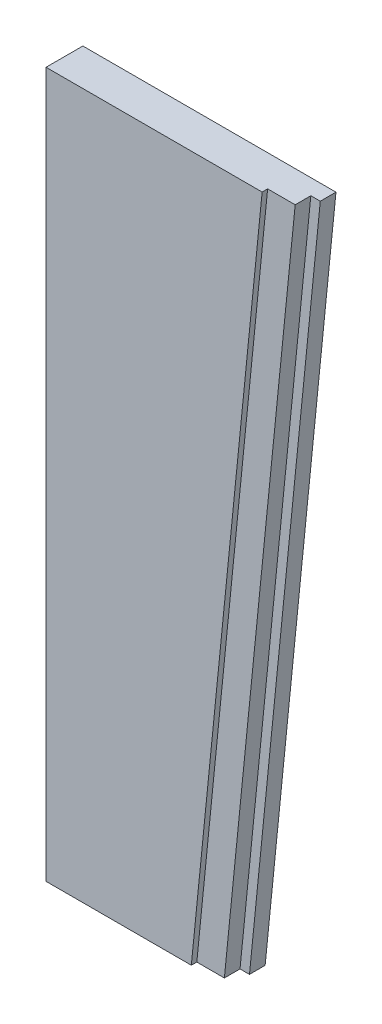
ISO-10303-21;
HEADER;
FILE_DESCRIPTION(('STEP AP214'),'2;1');
FILE_NAME('part.step','',(''),(''),'','','');
FILE_SCHEMA(('AUTOMOTIVE_DESIGN { 1 0 10303 214 1 1 1 1 }'));
ENDSEC;
DATA;
#1=APPLICATION_CONTEXT('core data for automotive mechanical design processes');
#2=APPLICATION_PROTOCOL_DEFINITION('international standard','automotive_design',2000,#1);
#3=PRODUCT_CONTEXT('',#1,'mechanical');
#4=PRODUCT('Part','Part','',(#3));
#5=PRODUCT_RELATED_PRODUCT_CATEGORY('part','',(#4));
#6=PRODUCT_DEFINITION_FORMATION('','',#4);
#7=PRODUCT_DEFINITION_CONTEXT('part definition',#1,'design');
#8=PRODUCT_DEFINITION('design','',#6,#7);
#9=PRODUCT_DEFINITION_SHAPE('','',#8);
#10=(LENGTH_UNIT() NAMED_UNIT(*) SI_UNIT(.MILLI.,.METRE.));
#11=(NAMED_UNIT(*) PLANE_ANGLE_UNIT() SI_UNIT($,.RADIAN.));
#12=(NAMED_UNIT(*) SI_UNIT($,.STERADIAN.) SOLID_ANGLE_UNIT());
#13=UNCERTAINTY_MEASURE_WITH_UNIT(LENGTH_MEASURE(1.E-05),#10,'distance_accuracy_value','');
#14=(GEOMETRIC_REPRESENTATION_CONTEXT(3) GLOBAL_UNCERTAINTY_ASSIGNED_CONTEXT((#13)) GLOBAL_UNIT_ASSIGNED_CONTEXT((#10,
#11,#12)) REPRESENTATION_CONTEXT('',''));
#15=CARTESIAN_POINT('',(0.,0.,0.));
#16=DIRECTION('',(0.,0.,1.));
#17=DIRECTION('',(1.,0.,0.));
#18=AXIS2_PLACEMENT_3D('',#15,#16,#17);
#19=CARTESIAN_POINT('',(-1786.46075731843,-2.18771119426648E-13,47.));
#20=DIRECTION('',(1.,0.,0.));
#21=DIRECTION('',(0.,0.,-1.));
#22=AXIS2_PLACEMENT_3D('',#19,#20,#21);
#23=PLANE('',#22);
#24=DIRECTION('',(0.,-1.,0.));
#25=VECTOR('',#24,1.);
#26=CARTESIAN_POINT('',(-1786.46075731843,-2.18771119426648E-13,0.));
#27=LINE('',#26,#25);
#28=CARTESIAN_POINT('',(-1786.46075731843,-2.18771119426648E-13,0.));
#29=VERTEX_POINT('',#28);
#30=CARTESIAN_POINT('',(-1786.46075731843,-900.,0.));
#31=VERTEX_POINT('',#30);
#32=EDGE_CURVE('E100',#29,#31,#27,.T.);
#33=ORIENTED_EDGE('',*,*,#32,.T.);
#34=DIRECTION('',(0.,0.,-1.));
#35=VECTOR('',#34,1.);
#36=CARTESIAN_POINT('',(-1786.46075731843,-900.,47.));
#37=LINE('',#36,#35);
#38=CARTESIAN_POINT('',(-1786.46075731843,-900.,47.));
#39=VERTEX_POINT('',#38);
#40=EDGE_CURVE('E11',#39,#31,#37,.T.);
#41=ORIENTED_EDGE('',*,*,#40,.F.);
#42=DIRECTION('',(0.,-1.,0.));
#43=VECTOR('',#42,1.);
#44=CARTESIAN_POINT('',(-1786.46075731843,-2.18771119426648E-13,47.));
#45=LINE('',#44,#43);
#46=CARTESIAN_POINT('',(-1786.46075731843,-2.18771119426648E-13,47.));
#47=VERTEX_POINT('',#46);
#48=EDGE_CURVE('E104',#47,#39,#45,.T.);
#49=ORIENTED_EDGE('',*,*,#48,.F.);
#50=DIRECTION('',(0.,0.,-1.));
#51=VECTOR('',#50,1.);
#52=CARTESIAN_POINT('',(-1786.46075731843,-2.18771119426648E-13,47.));
#53=LINE('',#52,#51);
#54=EDGE_CURVE('E156',#47,#29,#53,.T.);
#55=ORIENTED_EDGE('',*,*,#54,.T.);
#56=EDGE_LOOP('',(#33,#41,#49,#55));
#57=FACE_BOUND('',#56,.T.);
#58=ADVANCED_FACE('F31',(#57),#23,.F.);
#59=CARTESIAN_POINT('',(-1786.46075731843,-900.,47.));
#60=DIRECTION('',(0.,1.,0.));
#61=DIRECTION('',(-1.,0.,0.));
#62=AXIS2_PLACEMENT_3D('',#59,#60,#61);
#63=PLANE('',#62);
#64=DIRECTION('',(1.,0.,0.));
#65=VECTOR('',#64,1.);
#66=CARTESIAN_POINT('',(-1786.46075731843,-900.,0.));
#67=LINE('',#66,#65);
#68=CARTESIAN_POINT('',(-1553.76377674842,-900.000000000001,0.));
#69=VERTEX_POINT('',#68);
#70=EDGE_CURVE('E105',#31,#69,#67,.T.);
#71=ORIENTED_EDGE('',*,*,#70,.T.);
#72=DIRECTION('',(0.,0.,-1.));
#73=VECTOR('',#72,1.);
#74=CARTESIAN_POINT('',(-1553.76377674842,-900.000000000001,20.));
#75=LINE('',#74,#73);
#76=CARTESIAN_POINT('',(-1553.76377674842,-900.000000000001,20.));
#77=VERTEX_POINT('',#76);
#78=EDGE_CURVE('E115',#77,#69,#75,.T.);
#79=ORIENTED_EDGE('',*,*,#78,.F.);
#80=DIRECTION('',(-1.,0.,0.));
#81=VECTOR('',#80,1.);
#82=CARTESIAN_POINT('',(-1565.82415530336,-900.000000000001,20.));
#83=LINE('',#82,#81);
#84=CARTESIAN_POINT('',(-1565.82415530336,-900.000000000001,20.));
#85=VERTEX_POINT('',#84);
#86=EDGE_CURVE('E116',#77,#85,#83,.T.);
#87=ORIENTED_EDGE('',*,*,#86,.T.);
#88=DIRECTION('',(0.,0.,-1.));
#89=VECTOR('',#88,1.);
#90=CARTESIAN_POINT('',(-1565.82415530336,-900.000000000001,40.));
#91=LINE('',#90,#89);
#92=CARTESIAN_POINT('',(-1565.82415530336,-900.000000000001,40.));
#93=VERTEX_POINT('',#92);
#94=EDGE_CURVE('E142',#93,#85,#91,.T.);
#95=ORIENTED_EDGE('',*,*,#94,.F.);
#96=DIRECTION('',(-1.,0.,0.));
#97=VECTOR('',#96,1.);
#98=CARTESIAN_POINT('',(-1601.00025942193,-900.000000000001,40.));
#99=LINE('',#98,#97);
#100=CARTESIAN_POINT('',(-1601.00025942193,-900.000000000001,40.));
#101=VERTEX_POINT('',#100);
#102=EDGE_CURVE('E138',#93,#101,#99,.T.);
#103=ORIENTED_EDGE('',*,*,#102,.T.);
#104=DIRECTION('',(0.,0.,-1.));
#105=VECTOR('',#104,1.);
#106=CARTESIAN_POINT('',(-1601.00025942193,-900.000000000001,47.));
#107=LINE('',#106,#105);
#108=CARTESIAN_POINT('',(-1601.00025942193,-900.000000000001,47.));
#109=VERTEX_POINT('',#108);
#110=EDGE_CURVE('E38',#109,#101,#107,.T.);
#111=ORIENTED_EDGE('',*,*,#110,.F.);
#112=DIRECTION('',(1.,0.,0.));
#113=VECTOR('',#112,1.);
#114=CARTESIAN_POINT('',(-1786.46075731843,-900.,47.));
#115=LINE('',#114,#113);
#116=EDGE_CURVE('E150',#39,#109,#115,.T.);
#117=ORIENTED_EDGE('',*,*,#116,.F.);
#118=ORIENTED_EDGE('',*,*,#40,.T.);
#119=EDGE_LOOP('',(#71,#79,#87,#95,#103,#111,#117,#118));
#120=FACE_BOUND('',#119,.T.);
#121=ADVANCED_FACE('F171',(#120),#63,.F.);
#122=CARTESIAN_POINT('',(-1510.6032946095,-1.84989439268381E-13,47.));
#123=DIRECTION('',(-0.994993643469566,0.0999382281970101,0.));
#124=DIRECTION('',(-0.0999382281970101,-0.994993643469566,0.));
#125=AXIS2_PLACEMENT_3D('',#122,#123,#124);
#126=PLANE('',#125);
#127=ORIENTED_EDGE('',*,*,#110,.T.);
#128=DIRECTION('',(0.0999382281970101,0.994993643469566,0.));
#129=VECTOR('',#128,1.);
#130=CARTESIAN_POINT('',(-1510.6032946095,-1.84989439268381E-13,40.));
#131=LINE('',#130,#129);
#132=CARTESIAN_POINT('',(-1510.6032946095,-1.84989439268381E-13,40.));
#133=VERTEX_POINT('',#132);
#134=EDGE_CURVE('E48',#101,#133,#131,.T.);
#135=ORIENTED_EDGE('',*,*,#134,.T.);
#136=DIRECTION('',(0.,0.,-1.));
#137=VECTOR('',#136,1.);
#138=CARTESIAN_POINT('',(-1510.6032946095,-1.84989439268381E-13,47.));
#139=LINE('',#138,#137);
#140=CARTESIAN_POINT('',(-1510.6032946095,-1.84989439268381E-13,47.));
#141=VERTEX_POINT('',#140);
#142=EDGE_CURVE('E158',#141,#133,#139,.T.);
#143=ORIENTED_EDGE('',*,*,#142,.F.);
#144=DIRECTION('',(0.0999382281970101,0.994993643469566,0.));
#145=VECTOR('',#144,1.);
#146=CARTESIAN_POINT('',(-1510.6032946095,-1.84989439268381E-13,47.));
#147=LINE('',#146,#145);
#148=EDGE_CURVE('E152',#109,#141,#147,.T.);
#149=ORIENTED_EDGE('',*,*,#148,.F.);
#150=EDGE_LOOP('',(#127,#135,#143,#149));
#151=FACE_BOUND('',#150,.T.);
#152=ADVANCED_FACE('F177',(#151),#126,.F.);
#153=CARTESIAN_POINT('',(-1510.6032946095,-1.84989439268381E-13,47.));
#154=DIRECTION('',(0.,-1.,0.));
#155=DIRECTION('',(1.,0.,0.));
#156=AXIS2_PLACEMENT_3D('',#153,#154,#155);
#157=PLANE('',#156);
#158=DIRECTION('',(-1.,0.,0.));
#159=VECTOR('',#158,1.);
#160=CARTESIAN_POINT('',(-1510.6032946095,-1.84989439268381E-13,0.));
#161=LINE('',#160,#159);
#162=CARTESIAN_POINT('',(-1463.36681193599,0.,0.));
#163=VERTEX_POINT('',#162);
#164=EDGE_CURVE('E94',#163,#29,#161,.T.);
#165=ORIENTED_EDGE('',*,*,#164,.T.);
#166=ORIENTED_EDGE('',*,*,#54,.F.);
#167=DIRECTION('',(-1.,0.,0.));
#168=VECTOR('',#167,1.);
#169=CARTESIAN_POINT('',(-1510.6032946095,-1.84989439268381E-13,47.));
#170=LINE('',#169,#168);
#171=EDGE_CURVE('E154',#141,#47,#170,.T.);
#172=ORIENTED_EDGE('',*,*,#171,.F.);
#173=ORIENTED_EDGE('',*,*,#142,.T.);
#174=DIRECTION('',(1.,0.,0.));
#175=VECTOR('',#174,1.);
#176=CARTESIAN_POINT('',(-1510.6032946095,-1.84989439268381E-13,40.));
#177=LINE('',#176,#175);
#178=CARTESIAN_POINT('',(-1475.42719049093,0.,40.));
#179=VERTEX_POINT('',#178);
#180=EDGE_CURVE('E132',#133,#179,#177,.T.);
#181=ORIENTED_EDGE('',*,*,#180,.T.);
#182=DIRECTION('',(0.,0.,-1.));
#183=VECTOR('',#182,1.);
#184=CARTESIAN_POINT('',(-1475.42719049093,0.,40.));
#185=LINE('',#184,#183);
#186=CARTESIAN_POINT('',(-1475.42719049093,0.,20.));
#187=VERTEX_POINT('',#186);
#188=EDGE_CURVE('E141',#179,#187,#185,.T.);
#189=ORIENTED_EDGE('',*,*,#188,.T.);
#190=DIRECTION('',(1.,0.,0.));
#191=VECTOR('',#190,1.);
#192=CARTESIAN_POINT('',(-1475.42719049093,0.,20.));
#193=LINE('',#192,#191);
#194=CARTESIAN_POINT('',(-1463.36681193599,0.,20.));
#195=VERTEX_POINT('',#194);
#196=EDGE_CURVE('E111',#187,#195,#193,.T.);
#197=ORIENTED_EDGE('',*,*,#196,.T.);
#198=DIRECTION('',(0.,0.,-1.));
#199=VECTOR('',#198,1.);
#200=CARTESIAN_POINT('',(-1463.36681193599,0.,20.));
#201=LINE('',#200,#199);
#202=EDGE_CURVE('E108',#195,#163,#201,.T.);
#203=ORIENTED_EDGE('',*,*,#202,.T.);
#204=EDGE_LOOP('',(#165,#166,#172,#173,#181,#189,#197,#203));
#205=FACE_BOUND('',#204,.T.);
#206=ADVANCED_FACE('F109',(#205),#157,.F.);
#207=CARTESIAN_POINT('',(-1786.46075731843,-2.18771119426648E-13,47.));
#208=DIRECTION('',(0.,0.,-1.));
#209=DIRECTION('',(-1.,0.,0.));
#210=AXIS2_PLACEMENT_3D('',#207,#208,#209);
#211=PLANE('',#210);
#212=ORIENTED_EDGE('',*,*,#48,.T.);
#213=ORIENTED_EDGE('',*,*,#116,.T.);
#214=ORIENTED_EDGE('',*,*,#148,.T.);
#215=ORIENTED_EDGE('',*,*,#171,.T.);
#216=EDGE_LOOP('',(#212,#213,#214,#215));
#217=FACE_BOUND('',#216,.T.);
#218=ADVANCED_FACE('F176',(#217),#211,.F.);
#219=CARTESIAN_POINT('',(-1786.46075731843,-2.18771119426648E-13,0.));
#220=DIRECTION('',(0.,0.,-1.));
#221=DIRECTION('',(-1.,0.,0.));
#222=AXIS2_PLACEMENT_3D('',#219,#220,#221);
#223=PLANE('',#222);
#224=ORIENTED_EDGE('',*,*,#32,.F.);
#225=ORIENTED_EDGE('',*,*,#164,.F.);
#226=DIRECTION('',(-0.0999382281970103,-0.994993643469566,0.));
#227=VECTOR('',#226,1.);
#228=CARTESIAN_POINT('',(-1553.76377674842,-900.000000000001,0.));
#229=LINE('',#228,#227);
#230=EDGE_CURVE('E98',#163,#69,#229,.T.);
#231=ORIENTED_EDGE('',*,*,#230,.T.);
#232=ORIENTED_EDGE('',*,*,#70,.F.);
#233=EDGE_LOOP('',(#224,#225,#231,#232));
#234=FACE_BOUND('',#233,.T.);
#235=ADVANCED_FACE('F96',(#234),#223,.T.);
#236=CARTESIAN_POINT('',(-1565.82415530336,-900.000000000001,40.));
#237=DIRECTION('',(0.994993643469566,-0.0999382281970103,0.));
#238=DIRECTION('',(0.0999382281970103,0.994993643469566,0.));
#239=AXIS2_PLACEMENT_3D('',#236,#237,#238);
#240=PLANE('',#239);
#241=DIRECTION('',(0.0999382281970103,0.994993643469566,0.));
#242=VECTOR('',#241,1.);
#243=CARTESIAN_POINT('',(-1475.42719049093,0.,20.));
#244=LINE('',#243,#242);
#245=EDGE_CURVE('E120',#85,#187,#244,.T.);
#246=ORIENTED_EDGE('',*,*,#245,.T.);
#247=ORIENTED_EDGE('',*,*,#188,.F.);
#248=DIRECTION('',(-0.0999382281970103,-0.994993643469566,0.));
#249=VECTOR('',#248,1.);
#250=CARTESIAN_POINT('',(-1565.82415530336,-900.000000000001,40.));
#251=LINE('',#250,#249);
#252=EDGE_CURVE('E135',#179,#93,#251,.T.);
#253=ORIENTED_EDGE('',*,*,#252,.T.);
#254=ORIENTED_EDGE('',*,*,#94,.T.);
#255=EDGE_LOOP('',(#246,#247,#253,#254));
#256=FACE_BOUND('',#255,.T.);
#257=ADVANCED_FACE('F166',(#256),#240,.T.);
#258=CARTESIAN_POINT('',(-1601.00025942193,-900.000000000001,40.));
#259=DIRECTION('',(0.,0.,1.));
#260=DIRECTION('',(1.,0.,0.));
#261=AXIS2_PLACEMENT_3D('',#258,#259,#260);
#262=PLANE('',#261);
#263=ORIENTED_EDGE('',*,*,#134,.F.);
#264=ORIENTED_EDGE('',*,*,#102,.F.);
#265=ORIENTED_EDGE('',*,*,#252,.F.);
#266=ORIENTED_EDGE('',*,*,#180,.F.);
#267=EDGE_LOOP('',(#263,#264,#265,#266));
#268=FACE_BOUND('',#267,.T.);
#269=ADVANCED_FACE('F163',(#268),#262,.T.);
#270=CARTESIAN_POINT('',(-1553.76377674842,-900.000000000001,20.));
#271=DIRECTION('',(0.994993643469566,-0.0999382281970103,0.));
#272=DIRECTION('',(0.0999382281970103,0.994993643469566,0.));
#273=AXIS2_PLACEMENT_3D('',#270,#271,#272);
#274=PLANE('',#273);
#275=ORIENTED_EDGE('',*,*,#230,.F.);
#276=ORIENTED_EDGE('',*,*,#202,.F.);
#277=DIRECTION('',(-0.0999382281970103,-0.994993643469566,0.));
#278=VECTOR('',#277,1.);
#279=CARTESIAN_POINT('',(-1553.76377674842,-900.000000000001,20.));
#280=LINE('',#279,#278);
#281=EDGE_CURVE('E126',#195,#77,#280,.T.);
#282=ORIENTED_EDGE('',*,*,#281,.T.);
#283=ORIENTED_EDGE('',*,*,#78,.T.);
#284=EDGE_LOOP('',(#275,#276,#282,#283));
#285=FACE_BOUND('',#284,.T.);
#286=ADVANCED_FACE('F119',(#285),#274,.T.);
#287=CARTESIAN_POINT('',(-1565.82415530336,-900.000000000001,20.));
#288=DIRECTION('',(0.,0.,1.));
#289=DIRECTION('',(1.,0.,0.));
#290=AXIS2_PLACEMENT_3D('',#287,#288,#289);
#291=PLANE('',#290);
#292=ORIENTED_EDGE('',*,*,#245,.F.);
#293=ORIENTED_EDGE('',*,*,#86,.F.);
#294=ORIENTED_EDGE('',*,*,#281,.F.);
#295=ORIENTED_EDGE('',*,*,#196,.F.);
#296=EDGE_LOOP('',(#292,#293,#294,#295));
#297=FACE_BOUND('',#296,.T.);
#298=ADVANCED_FACE('F169',(#297),#291,.T.);
#299=CLOSED_SHELL('',(#58,#121,#152,#206,#218,#235,#257,#269,#286,#298));
#300=MANIFOLD_SOLID_BREP('B2',#299);
#301=ADVANCED_BREP_SHAPE_REPRESENTATION('',(#18,#300),#14);
#302=SHAPE_DEFINITION_REPRESENTATION(#9,#301);
ENDSEC;
END-ISO-10303-21;
